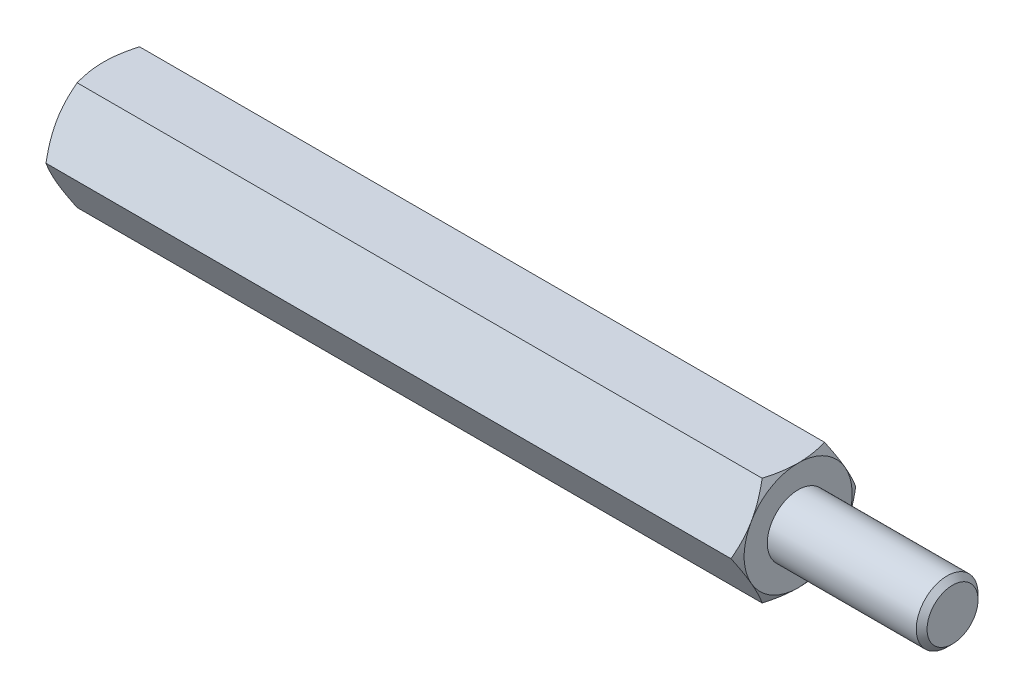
from build123d import *

# Parameters (mm, degrees)
EXTRUDE2_DEPTH = 22.5
SKETCH3_R      = 1.65
EXTRUDE3_DEPTH = 10
SKETCH5_R      = 2
EXTRUDE4_DEPTH = 10
CHAMFER1_SIZE  = 0.35


with BuildPart() as part:
    # Sketch1 → Extrude2 (new, symmetric)
    with BuildSketch(Plane(origin=(0, 0, 0), x_dir=(0, 0, -1), z_dir=(1, 0, 0))):
        Polygon((2.020725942, 3.5), (-2.020725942, 3.5), (-4.041451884, 0), (-2.020725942, -3.5), (2.020725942, -3.5), (4.041451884, 0), align=None)
    extrude(amount=EXTRUDE2_DEPTH, both=True)

    # Sketch2 → Cut-Revolve1 (revolve, cut)
    with BuildSketch(Plane.XY):
        with BuildLine():
            Line((-22.5, 3.5), (-21, 6.098076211))
            ThreePointArc((-21, 6.098076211), (-21.48810136, 7.276457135), (-22.5, 6.5))
            Line((-22.5, 6.5), (-22.5, 3.5))
        make_face()
    cut_revolve1 = revolve(axis=Axis((0, 0, 0), (1, 0, 0)), mode=Mode.SUBTRACT)

    # Mirror1: Cut-Revolve1 across plane
    add(cut_revolve1.mirror(Plane(origin=(0, 0, 0), x_dir=(0, 0, 1), z_dir=(1, 0, 0))), mode=Mode.SUBTRACT)

    # Sketch3 → Extrude3 (cut)
    with BuildSketch(Plane.ZY.offset(22.5)):
        Circle(SKETCH3_R)
    extrude(amount=-EXTRUDE3_DEPTH, mode=Mode.SUBTRACT)

    # Sketch4 → Cut-Revolve2 (revolve, cut)
    with BuildSketch(Plane.XY, mode=Mode.PRIVATE) as cut_revolve2_sk:
        Polygon((-12.5, 0), (-12.5, 1.65), (-11.547372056, 0), align=None)
    revolve(cut_revolve2_sk.sketch.rotate(Axis((-11.547372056, 0, 0), (-1, 0, 0)), 270), axis=Axis((-11.547372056, 0, 0), (-1, 0, 0)), mode=Mode.SUBTRACT)

    # Sketch5 → Extrude4 (add)
    with BuildSketch(Plane(origin=(22.5, 0, 0), x_dir=(0, 0, -1), z_dir=(1, 0, 0))):
        Circle(SKETCH5_R)
    extrude(amount=EXTRUDE4_DEPTH)

    # Chamfer1
    chamfer1_edges = [part.edges().sort_by_distance(p)[0] for p in [
        (32.5, 0, 2),
    ]]
    chamfer(chamfer1_edges, length=CHAMFER1_SIZE)


solid = part.part
